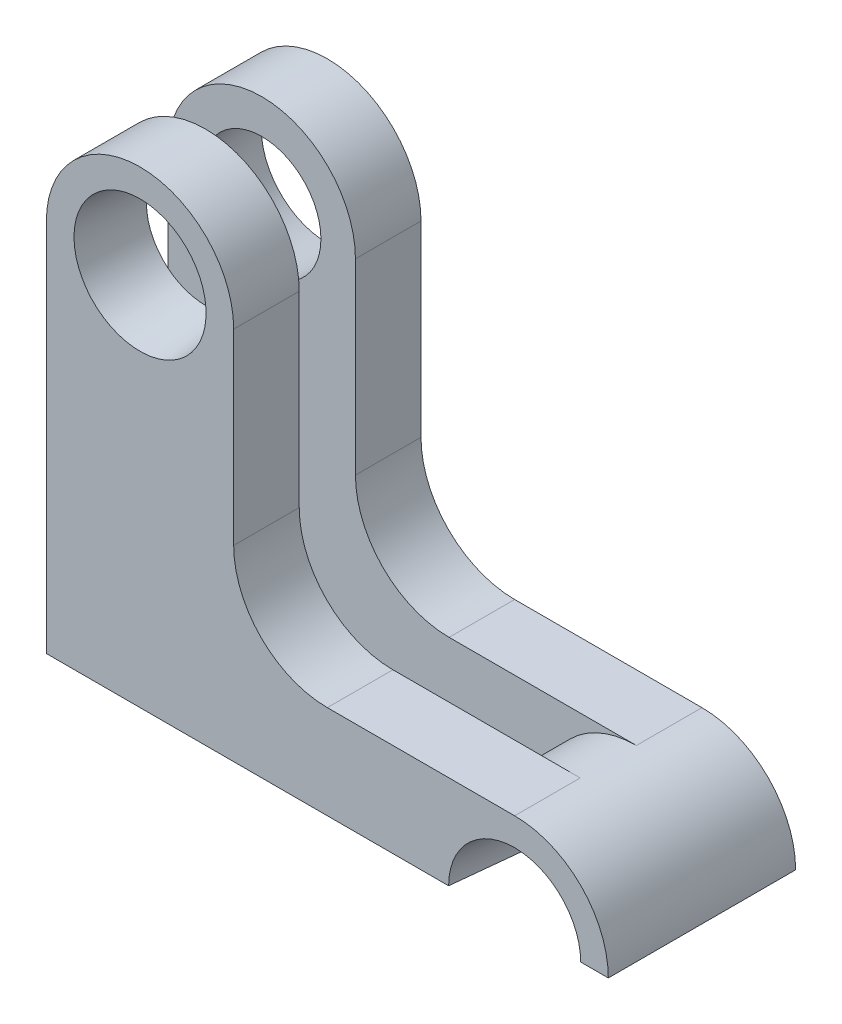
ISO-10303-21;
HEADER;
FILE_DESCRIPTION(('STEP AP214'),'2;1');
FILE_NAME('part.step','',(''),(''),'','','');
FILE_SCHEMA(('AUTOMOTIVE_DESIGN { 1 0 10303 214 1 1 1 1 }'));
ENDSEC;
DATA;
#1=APPLICATION_CONTEXT('core data for automotive mechanical design processes');
#2=APPLICATION_PROTOCOL_DEFINITION('international standard','automotive_design',2000,#1);
#3=PRODUCT_CONTEXT('',#1,'mechanical');
#4=PRODUCT('Part','Part','',(#3));
#5=PRODUCT_RELATED_PRODUCT_CATEGORY('part','',(#4));
#6=PRODUCT_DEFINITION_FORMATION('','',#4);
#7=PRODUCT_DEFINITION_CONTEXT('part definition',#1,'design');
#8=PRODUCT_DEFINITION('design','',#6,#7);
#9=PRODUCT_DEFINITION_SHAPE('','',#8);
#10=(LENGTH_UNIT() NAMED_UNIT(*) SI_UNIT(.MILLI.,.METRE.));
#11=(NAMED_UNIT(*) PLANE_ANGLE_UNIT() SI_UNIT($,.RADIAN.));
#12=(NAMED_UNIT(*) SI_UNIT($,.STERADIAN.) SOLID_ANGLE_UNIT());
#13=UNCERTAINTY_MEASURE_WITH_UNIT(LENGTH_MEASURE(1.E-05),#10,'distance_accuracy_value','');
#14=(GEOMETRIC_REPRESENTATION_CONTEXT(3) GLOBAL_UNCERTAINTY_ASSIGNED_CONTEXT((#13)) GLOBAL_UNIT_ASSIGNED_CONTEXT((#10,
#11,#12)) REPRESENTATION_CONTEXT('',''));
#15=CARTESIAN_POINT('',(0.,0.,0.));
#16=DIRECTION('',(0.,0.,1.));
#17=DIRECTION('',(1.,0.,0.));
#18=AXIS2_PLACEMENT_3D('',#15,#16,#17);
#19=CARTESIAN_POINT('',(0.,10.,10.));
#20=DIRECTION('',(0.,0.,-1.));
#21=DIRECTION('',(-1.,0.,0.));
#22=AXIS2_PLACEMENT_3D('',#19,#20,#21);
#23=PLANE('',#22);
#24=CARTESIAN_POINT('',(-40.,50.,10.));
#25=DIRECTION('',(0.,0.,-1.));
#26=DIRECTION('',(-1.,0.,0.));
#27=AXIS2_PLACEMENT_3D('',#24,#25,#26);
#28=CIRCLE('',#27,7.05104235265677);
#29=CARTESIAN_POINT('',(-47.0510423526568,50.,10.));
#30=VERTEX_POINT('',#29);
#31=EDGE_CURVE('E190',#30,#30,#28,.F.);
#32=ORIENTED_EDGE('',*,*,#31,.F.);
#33=EDGE_LOOP('',(#32));
#34=FACE_BOUND('',#33,.T.);
#35=DIRECTION('',(-1.,0.,0.));
#36=VECTOR('',#35,1.);
#37=CARTESIAN_POINT('',(0.,10.,10.));
#38=LINE('',#37,#36);
#39=CARTESIAN_POINT('',(10.,10.,10.));
#40=VERTEX_POINT('',#39);
#41=CARTESIAN_POINT('',(7.05104235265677,10.,10.));
#42=VERTEX_POINT('',#41);
#43=EDGE_CURVE('E48',#40,#42,#38,.T.);
#44=ORIENTED_EDGE('',*,*,#43,.F.);
#45=CARTESIAN_POINT('',(0.,10.,10.));
#46=DIRECTION('',(0.,0.,-1.));
#47=DIRECTION('',(-1.,0.,0.));
#48=AXIS2_PLACEMENT_3D('',#45,#46,#47);
#49=CIRCLE('',#48,10.);
#50=CARTESIAN_POINT('',(0.,20.,10.));
#51=VERTEX_POINT('',#50);
#52=EDGE_CURVE('E228',#51,#40,#49,.T.);
#53=ORIENTED_EDGE('',*,*,#52,.F.);
#54=DIRECTION('',(1.,0.,0.));
#55=VECTOR('',#54,1.);
#56=CARTESIAN_POINT('',(-19.9999999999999,20.,10.));
#57=LINE('',#56,#55);
#58=CARTESIAN_POINT('',(-19.9999999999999,20.,10.));
#59=VERTEX_POINT('',#58);
#60=EDGE_CURVE('E213',#59,#51,#57,.T.);
#61=ORIENTED_EDGE('',*,*,#60,.F.);
#62=CARTESIAN_POINT('',(-20.,30.,10.));
#63=DIRECTION('',(0.,0.,1.));
#64=DIRECTION('',(1.,0.,0.));
#65=AXIS2_PLACEMENT_3D('',#62,#63,#64);
#66=CIRCLE('',#65,10.);
#67=CARTESIAN_POINT('',(-30.,30.0000000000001,10.));
#68=VERTEX_POINT('',#67);
#69=EDGE_CURVE('E216',#68,#59,#66,.T.);
#70=ORIENTED_EDGE('',*,*,#69,.F.);
#71=DIRECTION('',(0.,-1.,0.));
#72=VECTOR('',#71,1.);
#73=CARTESIAN_POINT('',(-30.,50.,10.));
#74=LINE('',#73,#72);
#75=CARTESIAN_POINT('',(-30.,50.,10.));
#76=VERTEX_POINT('',#75);
#77=EDGE_CURVE('E219',#76,#68,#74,.T.);
#78=ORIENTED_EDGE('',*,*,#77,.F.);
#79=CARTESIAN_POINT('',(-40.,50.,10.));
#80=DIRECTION('',(0.,0.,-1.));
#81=DIRECTION('',(-1.,0.,0.));
#82=AXIS2_PLACEMENT_3D('',#79,#80,#81);
#83=CIRCLE('',#82,9.99999999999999);
#84=CARTESIAN_POINT('',(-50.,50.,10.));
#85=VERTEX_POINT('',#84);
#86=EDGE_CURVE('E222',#85,#76,#83,.T.);
#87=ORIENTED_EDGE('',*,*,#86,.F.);
#88=DIRECTION('',(0.,1.,0.));
#89=VECTOR('',#88,1.);
#90=CARTESIAN_POINT('',(-50.,10.0000000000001,10.));
#91=LINE('',#90,#89);
#92=CARTESIAN_POINT('',(-50.,10.0000000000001,10.));
#93=VERTEX_POINT('',#92);
#94=EDGE_CURVE('E225',#93,#85,#91,.T.);
#95=ORIENTED_EDGE('',*,*,#94,.F.);
#96=CARTESIAN_POINT('',(-7.05104235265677,10.,10.));
#97=VERTEX_POINT('',#96);
#98=EDGE_CURVE('E288',#97,#93,#38,.T.);
#99=ORIENTED_EDGE('',*,*,#98,.F.);
#100=CARTESIAN_POINT('',(0.,10.,10.));
#101=DIRECTION('',(0.,0.,-1.));
#102=DIRECTION('',(-1.,0.,0.));
#103=AXIS2_PLACEMENT_3D('',#100,#101,#102);
#104=CIRCLE('',#103,7.05104235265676);
#105=EDGE_CURVE('E161',#42,#97,#104,.F.);
#106=ORIENTED_EDGE('',*,*,#105,.F.);
#107=EDGE_LOOP('',(#44,#53,#61,#70,#78,#87,#95,#99,#106));
#108=FACE_BOUND('',#107,.T.);
#109=ADVANCED_FACE('F33',(#34,#108),#23,.F.);
#110=CARTESIAN_POINT('',(10.,60.001,3.));
#111=DIRECTION('',(0.,0.,-1.));
#112=DIRECTION('',(-1.,0.,0.));
#113=AXIS2_PLACEMENT_3D('',#110,#111,#112);
#114=PLANE('',#113);
#115=CARTESIAN_POINT('',(-40.,50.,3.));
#116=DIRECTION('',(0.,0.,-1.));
#117=DIRECTION('',(-1.,0.,0.));
#118=AXIS2_PLACEMENT_3D('',#115,#116,#117);
#119=CIRCLE('',#118,6.31531270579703);
#120=CARTESIAN_POINT('',(-46.315312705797,50.,3.));
#121=VERTEX_POINT('',#120);
#122=EDGE_CURVE('E184',#121,#121,#119,.F.);
#123=ORIENTED_EDGE('',*,*,#122,.T.);
#124=EDGE_LOOP('',(#123));
#125=FACE_BOUND('',#124,.T.);
#126=CARTESIAN_POINT('',(0.,10.,3.));
#127=DIRECTION('',(0.,0.,-1.));
#128=DIRECTION('',(-1.,0.,0.));
#129=AXIS2_PLACEMENT_3D('',#126,#127,#128);
#130=CIRCLE('',#129,10.);
#131=CARTESIAN_POINT('',(-10.,10.,3.));
#132=VERTEX_POINT('',#131);
#133=CARTESIAN_POINT('',(0.,20.,3.));
#134=VERTEX_POINT('',#133);
#135=EDGE_CURVE('E270',#132,#134,#130,.T.);
#136=ORIENTED_EDGE('',*,*,#135,.F.);
#137=DIRECTION('',(-1.,0.,0.));
#138=VECTOR('',#137,1.);
#139=CARTESIAN_POINT('',(10.,10.,3.));
#140=LINE('',#139,#138);
#141=CARTESIAN_POINT('',(-50.,10.,3.));
#142=VERTEX_POINT('',#141);
#143=EDGE_CURVE('E283',#132,#142,#140,.T.);
#144=ORIENTED_EDGE('',*,*,#143,.T.);
#145=DIRECTION('',(0.,-1.,0.));
#146=VECTOR('',#145,1.);
#147=CARTESIAN_POINT('',(-50.,60.001,3.));
#148=LINE('',#147,#146);
#149=CARTESIAN_POINT('',(-50.,50.,3.));
#150=VERTEX_POINT('',#149);
#151=EDGE_CURVE('E269',#150,#142,#148,.T.);
#152=ORIENTED_EDGE('',*,*,#151,.F.);
#153=CARTESIAN_POINT('',(-40.,50.,3.));
#154=DIRECTION('',(0.,0.,-1.));
#155=DIRECTION('',(-1.,0.,0.));
#156=AXIS2_PLACEMENT_3D('',#153,#154,#155);
#157=CIRCLE('',#156,9.99999999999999);
#158=CARTESIAN_POINT('',(-30.,50.,3.));
#159=VERTEX_POINT('',#158);
#160=EDGE_CURVE('E266',#159,#150,#157,.F.);
#161=ORIENTED_EDGE('',*,*,#160,.F.);
#162=DIRECTION('',(0.,1.,0.));
#163=VECTOR('',#162,1.);
#164=CARTESIAN_POINT('',(-30.,50.,3.));
#165=LINE('',#164,#163);
#166=CARTESIAN_POINT('',(-30.,30.0000000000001,3.));
#167=VERTEX_POINT('',#166);
#168=EDGE_CURVE('E263',#167,#159,#165,.T.);
#169=ORIENTED_EDGE('',*,*,#168,.F.);
#170=CARTESIAN_POINT('',(-20.,30.,3.));
#171=DIRECTION('',(0.,0.,-1.));
#172=DIRECTION('',(-1.,0.,0.));
#173=AXIS2_PLACEMENT_3D('',#170,#171,#172);
#174=CIRCLE('',#173,10.);
#175=CARTESIAN_POINT('',(-19.9999999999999,20.,3.));
#176=VERTEX_POINT('',#175);
#177=EDGE_CURVE('E260',#176,#167,#174,.T.);
#178=ORIENTED_EDGE('',*,*,#177,.F.);
#179=DIRECTION('',(-1.,0.,0.));
#180=VECTOR('',#179,1.);
#181=CARTESIAN_POINT('',(-19.9999999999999,20.,3.));
#182=LINE('',#181,#180);
#183=EDGE_CURVE('E257',#134,#176,#182,.T.);
#184=ORIENTED_EDGE('',*,*,#183,.F.);
#185=EDGE_LOOP('',(#136,#144,#152,#161,#169,#178,#184));
#186=FACE_BOUND('',#185,.T.);
#187=ADVANCED_FACE('F350',(#125,#186),#114,.T.);
#188=CARTESIAN_POINT('',(0.,10.,10.));
#189=DIRECTION('',(0.,0.,-1.));
#190=DIRECTION('',(-1.,0.,0.));
#191=AXIS2_PLACEMENT_3D('',#188,#189,#190);
#192=CYLINDRICAL_SURFACE('',#191,10.);
#193=CARTESIAN_POINT('',(0.,10.,-3.));
#194=DIRECTION('',(0.,0.,1.));
#195=DIRECTION('',(1.,0.,0.));
#196=AXIS2_PLACEMENT_3D('',#193,#194,#195);
#197=CIRCLE('',#196,10.);
#198=CARTESIAN_POINT('',(0.,20.,-3.));
#199=VERTEX_POINT('',#198);
#200=CARTESIAN_POINT('',(-10.,10.,-3.));
#201=VERTEX_POINT('',#200);
#202=EDGE_CURVE('E273',#199,#201,#197,.T.);
#203=ORIENTED_EDGE('',*,*,#202,.T.);
#204=DIRECTION('',(0.,0.,-1.));
#205=VECTOR('',#204,1.);
#206=CARTESIAN_POINT('',(-10.,10.,10.));
#207=LINE('',#206,#205);
#208=EDGE_CURVE('E56',#201,#132,#207,.F.);
#209=ORIENTED_EDGE('',*,*,#208,.T.);
#210=ORIENTED_EDGE('',*,*,#135,.T.);
#211=DIRECTION('',(0.,0.,-1.));
#212=VECTOR('',#211,1.);
#213=CARTESIAN_POINT('',(0.,20.,10.));
#214=LINE('',#213,#212);
#215=EDGE_CURVE('E178',#51,#134,#214,.T.);
#216=ORIENTED_EDGE('',*,*,#215,.F.);
#217=ORIENTED_EDGE('',*,*,#52,.T.);
#218=DIRECTION('',(0.,0.,1.));
#219=VECTOR('',#218,1.);
#220=CARTESIAN_POINT('',(10.,10.,-98.9724735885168));
#221=LINE('',#220,#219);
#222=CARTESIAN_POINT('',(10.,10.,-10.));
#223=VERTEX_POINT('',#222);
#224=EDGE_CURVE('E294',#223,#40,#221,.T.);
#225=ORIENTED_EDGE('',*,*,#224,.F.);
#226=CARTESIAN_POINT('',(0.,10.,-10.));
#227=DIRECTION('',(0.,0.,-1.));
#228=DIRECTION('',(-1.,0.,0.));
#229=AXIS2_PLACEMENT_3D('',#226,#227,#228);
#230=CIRCLE('',#229,10.);
#231=CARTESIAN_POINT('',(0.,20.,-10.));
#232=VERTEX_POINT('',#231);
#233=EDGE_CURVE('E170',#232,#223,#230,.T.);
#234=ORIENTED_EDGE('',*,*,#233,.F.);
#235=EDGE_CURVE('E180',#199,#232,#214,.T.);
#236=ORIENTED_EDGE('',*,*,#235,.F.);
#237=EDGE_LOOP('',(#203,#209,#210,#216,#217,#225,#234,#236));
#238=FACE_BOUND('',#237,.T.);
#239=ADVANCED_FACE('F35',(#238),#192,.T.);
#240=CARTESIAN_POINT('',(0.,10.,-10.));
#241=DIRECTION('',(0.,0.,-1.));
#242=DIRECTION('',(-1.,0.,0.));
#243=AXIS2_PLACEMENT_3D('',#240,#241,#242);
#244=PLANE('',#243);
#245=CARTESIAN_POINT('',(-40.,50.,-10.));
#246=DIRECTION('',(0.,0.,-1.));
#247=DIRECTION('',(-1.,0.,0.));
#248=AXIS2_PLACEMENT_3D('',#245,#246,#247);
#249=CIRCLE('',#248,7.05104235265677);
#250=CARTESIAN_POINT('',(-47.0510423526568,50.,-10.));
#251=VERTEX_POINT('',#250);
#252=EDGE_CURVE('E189',#251,#251,#249,.T.);
#253=ORIENTED_EDGE('',*,*,#252,.F.);
#254=EDGE_LOOP('',(#253));
#255=FACE_BOUND('',#254,.T.);
#256=ORIENTED_EDGE('',*,*,#233,.T.);
#257=DIRECTION('',(-1.,0.,0.));
#258=VECTOR('',#257,1.);
#259=CARTESIAN_POINT('',(0.,10.,-10.));
#260=LINE('',#259,#258);
#261=CARTESIAN_POINT('',(7.05104235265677,10.,-9.99999999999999));
#262=VERTEX_POINT('',#261);
#263=EDGE_CURVE('E166',#223,#262,#260,.T.);
#264=ORIENTED_EDGE('',*,*,#263,.T.);
#265=CARTESIAN_POINT('',(0.,10.,-10.));
#266=DIRECTION('',(0.,0.,-1.));
#267=DIRECTION('',(-1.,0.,0.));
#268=AXIS2_PLACEMENT_3D('',#265,#266,#267);
#269=CIRCLE('',#268,7.05104235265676);
#270=CARTESIAN_POINT('',(-7.05104235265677,10.,-10.));
#271=VERTEX_POINT('',#270);
#272=EDGE_CURVE('E154',#271,#262,#269,.T.);
#273=ORIENTED_EDGE('',*,*,#272,.F.);
#274=CARTESIAN_POINT('',(-50.,10.0000000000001,-10.));
#275=VERTEX_POINT('',#274);
#276=EDGE_CURVE('E175',#271,#275,#260,.T.);
#277=ORIENTED_EDGE('',*,*,#276,.T.);
#278=DIRECTION('',(0.,1.,0.));
#279=VECTOR('',#278,1.);
#280=CARTESIAN_POINT('',(-50.,10.0000000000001,-10.));
#281=LINE('',#280,#279);
#282=CARTESIAN_POINT('',(-50.,50.,-10.));
#283=VERTEX_POINT('',#282);
#284=EDGE_CURVE('E241',#275,#283,#281,.T.);
#285=ORIENTED_EDGE('',*,*,#284,.T.);
#286=CARTESIAN_POINT('',(-40.,50.,-10.));
#287=DIRECTION('',(0.,0.,-1.));
#288=DIRECTION('',(-1.,0.,0.));
#289=AXIS2_PLACEMENT_3D('',#286,#287,#288);
#290=CIRCLE('',#289,9.99999999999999);
#291=CARTESIAN_POINT('',(-30.,50.,-10.));
#292=VERTEX_POINT('',#291);
#293=EDGE_CURVE('E238',#283,#292,#290,.T.);
#294=ORIENTED_EDGE('',*,*,#293,.T.);
#295=DIRECTION('',(0.,-1.,0.));
#296=VECTOR('',#295,1.);
#297=CARTESIAN_POINT('',(-30.,50.,-10.));
#298=LINE('',#297,#296);
#299=CARTESIAN_POINT('',(-30.,30.0000000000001,-10.));
#300=VERTEX_POINT('',#299);
#301=EDGE_CURVE('E235',#292,#300,#298,.T.);
#302=ORIENTED_EDGE('',*,*,#301,.T.);
#303=CARTESIAN_POINT('',(-20.,30.,-10.));
#304=DIRECTION('',(0.,0.,1.));
#305=DIRECTION('',(1.,0.,0.));
#306=AXIS2_PLACEMENT_3D('',#303,#304,#305);
#307=CIRCLE('',#306,10.);
#308=CARTESIAN_POINT('',(-19.9999999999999,20.,-10.));
#309=VERTEX_POINT('',#308);
#310=EDGE_CURVE('E232',#300,#309,#307,.T.);
#311=ORIENTED_EDGE('',*,*,#310,.T.);
#312=DIRECTION('',(1.,0.,0.));
#313=VECTOR('',#312,1.);
#314=CARTESIAN_POINT('',(-19.9999999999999,20.,-10.));
#315=LINE('',#314,#313);
#316=EDGE_CURVE('E230',#309,#232,#315,.T.);
#317=ORIENTED_EDGE('',*,*,#316,.T.);
#318=EDGE_LOOP('',(#256,#264,#273,#277,#285,#294,#302,#311,#317));
#319=FACE_BOUND('',#318,.T.);
#320=ADVANCED_FACE('F167',(#255,#319),#244,.T.);
#321=CARTESIAN_POINT('',(10.,60.001,-3.));
#322=DIRECTION('',(0.,0.,1.));
#323=DIRECTION('',(1.,0.,0.));
#324=AXIS2_PLACEMENT_3D('',#321,#322,#323);
#325=PLANE('',#324);
#326=CARTESIAN_POINT('',(-40.,50.,-3.));
#327=DIRECTION('',(0.,0.,1.));
#328=DIRECTION('',(1.,0.,0.));
#329=AXIS2_PLACEMENT_3D('',#326,#327,#328);
#330=CIRCLE('',#329,6.31531270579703);
#331=CARTESIAN_POINT('',(-33.684687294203,50.,-3.));
#332=VERTEX_POINT('',#331);
#333=EDGE_CURVE('E186',#332,#332,#330,.T.);
#334=ORIENTED_EDGE('',*,*,#333,.F.);
#335=EDGE_LOOP('',(#334));
#336=FACE_BOUND('',#335,.T.);
#337=DIRECTION('',(0.,-1.,0.));
#338=VECTOR('',#337,1.);
#339=CARTESIAN_POINT('',(-50.,60.001,-3.));
#340=LINE('',#339,#338);
#341=CARTESIAN_POINT('',(-50.,50.,-3.));
#342=VERTEX_POINT('',#341);
#343=CARTESIAN_POINT('',(-50.,9.99999999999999,-3.));
#344=VERTEX_POINT('',#343);
#345=EDGE_CURVE('E272',#342,#344,#340,.T.);
#346=ORIENTED_EDGE('',*,*,#345,.T.);
#347=DIRECTION('',(1.,0.,0.));
#348=VECTOR('',#347,1.);
#349=CARTESIAN_POINT('',(10.,10.,-3.));
#350=LINE('',#349,#348);
#351=EDGE_CURVE('E286',#344,#201,#350,.T.);
#352=ORIENTED_EDGE('',*,*,#351,.T.);
#353=ORIENTED_EDGE('',*,*,#202,.F.);
#354=DIRECTION('',(1.,0.,0.));
#355=VECTOR('',#354,1.);
#356=CARTESIAN_POINT('',(-19.9999999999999,20.,-3.));
#357=LINE('',#356,#355);
#358=CARTESIAN_POINT('',(-19.9999999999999,20.,-3.));
#359=VERTEX_POINT('',#358);
#360=EDGE_CURVE('E245',#359,#199,#357,.T.);
#361=ORIENTED_EDGE('',*,*,#360,.F.);
#362=CARTESIAN_POINT('',(-20.,30.,-3.));
#363=DIRECTION('',(0.,0.,1.));
#364=DIRECTION('',(1.,0.,0.));
#365=AXIS2_PLACEMENT_3D('',#362,#363,#364);
#366=CIRCLE('',#365,10.);
#367=CARTESIAN_POINT('',(-30.,30.0000000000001,-3.));
#368=VERTEX_POINT('',#367);
#369=EDGE_CURVE('E248',#368,#359,#366,.T.);
#370=ORIENTED_EDGE('',*,*,#369,.F.);
#371=DIRECTION('',(0.,-1.,0.));
#372=VECTOR('',#371,1.);
#373=CARTESIAN_POINT('',(-30.,50.,-3.));
#374=LINE('',#373,#372);
#375=CARTESIAN_POINT('',(-30.,50.,-3.));
#376=VERTEX_POINT('',#375);
#377=EDGE_CURVE('E251',#376,#368,#374,.T.);
#378=ORIENTED_EDGE('',*,*,#377,.F.);
#379=CARTESIAN_POINT('',(-40.,50.,-3.));
#380=DIRECTION('',(0.,0.,1.));
#381=DIRECTION('',(1.,0.,0.));
#382=AXIS2_PLACEMENT_3D('',#379,#380,#381);
#383=CIRCLE('',#382,9.99999999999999);
#384=EDGE_CURVE('E254',#342,#376,#383,.F.);
#385=ORIENTED_EDGE('',*,*,#384,.F.);
#386=EDGE_LOOP('',(#346,#352,#353,#361,#370,#378,#385));
#387=FACE_BOUND('',#386,.T.);
#388=ADVANCED_FACE('F327',(#336,#387),#325,.T.);
#389=CARTESIAN_POINT('',(0.,10.,0.));
#390=DIRECTION('',(0.,0.,1.));
#391=DIRECTION('',(1.,0.,0.));
#392=AXIS2_PLACEMENT_3D('',#389,#390,#391);
#393=CONICAL_SURFACE('',#392,6.,0.10471975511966);
#394=CARTESIAN_POINT('',(0.,10.,0.));
#395=DIRECTION('',(0.,0.,1.));
#396=DIRECTION('',(1.,0.,0.));
#397=AXIS2_PLACEMENT_3D('',#394,#395,#396);
#398=CIRCLE('',#397,6.);
#399=CARTESIAN_POINT('',(6.,10.,0.));
#400=VERTEX_POINT('',#399);
#401=CARTESIAN_POINT('',(-6.,10.,0.));
#402=VERTEX_POINT('',#401);
#403=EDGE_CURVE('E162',#400,#402,#398,.T.);
#404=ORIENTED_EDGE('',*,*,#403,.F.);
#405=DIRECTION('',(0.104528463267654,0.,0.994521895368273));
#406=VECTOR('',#405,1.);
#407=CARTESIAN_POINT('',(0.,10.,-57.0861867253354));
#408=LINE('',#407,#406);
#409=EDGE_CURVE('E173',#400,#42,#408,.T.);
#410=ORIENTED_EDGE('',*,*,#409,.T.);
#411=ORIENTED_EDGE('',*,*,#105,.T.);
#412=DIRECTION('',(0.104528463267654,0.,-0.994521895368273));
#413=VECTOR('',#412,1.);
#414=CARTESIAN_POINT('',(0.,10.,-57.0861867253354));
#415=LINE('',#414,#413);
#416=EDGE_CURVE('E289',#97,#402,#415,.T.);
#417=ORIENTED_EDGE('',*,*,#416,.T.);
#418=EDGE_LOOP('',(#404,#410,#411,#417));
#419=FACE_BOUND('',#418,.T.);
#420=ADVANCED_FACE('F390',(#419),#393,.F.);
#421=CARTESIAN_POINT('',(0.,10.,0.));
#422=DIRECTION('',(0.,0.,-1.));
#423=DIRECTION('',(1.,0.,0.));
#424=AXIS2_PLACEMENT_3D('',#421,#422,#423);
#425=CONICAL_SURFACE('',#424,6.,0.10471975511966);
#426=DIRECTION('',(-0.104528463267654,0.,-0.994521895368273));
#427=VECTOR('',#426,1.);
#428=CARTESIAN_POINT('',(0.,10.,57.0861867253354));
#429=LINE('',#428,#427);
#430=EDGE_CURVE('E11',#271,#402,#429,.F.);
#431=ORIENTED_EDGE('',*,*,#430,.F.);
#432=ORIENTED_EDGE('',*,*,#272,.T.);
#433=DIRECTION('',(-0.104528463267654,0.,0.994521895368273));
#434=VECTOR('',#433,1.);
#435=CARTESIAN_POINT('',(0.,10.,57.0861867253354));
#436=LINE('',#435,#434);
#437=EDGE_CURVE('E41',#400,#262,#436,.F.);
#438=ORIENTED_EDGE('',*,*,#437,.F.);
#439=ORIENTED_EDGE('',*,*,#403,.T.);
#440=EDGE_LOOP('',(#431,#432,#438,#439));
#441=FACE_BOUND('',#440,.T.);
#442=ADVANCED_FACE('F156',(#441),#425,.F.);
#443=CARTESIAN_POINT('',(-19.9999999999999,20.,10.));
#444=DIRECTION('',(0.,1.,0.));
#445=DIRECTION('',(-1.,0.,0.));
#446=AXIS2_PLACEMENT_3D('',#443,#444,#445);
#447=PLANE('',#446);
#448=DIRECTION('',(0.,0.,-1.));
#449=VECTOR('',#448,1.);
#450=CARTESIAN_POINT('',(-19.9999999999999,20.,10.));
#451=LINE('',#450,#449);
#452=EDGE_CURVE('E209',#359,#309,#451,.T.);
#453=ORIENTED_EDGE('',*,*,#452,.F.);
#454=ORIENTED_EDGE('',*,*,#360,.T.);
#455=ORIENTED_EDGE('',*,*,#235,.T.);
#456=ORIENTED_EDGE('',*,*,#316,.F.);
#457=EDGE_LOOP('',(#453,#454,#455,#456));
#458=FACE_BOUND('',#457,.T.);
#459=ADVANCED_FACE('F331',(#458),#447,.T.);
#460=ORIENTED_EDGE('',*,*,#215,.T.);
#461=ORIENTED_EDGE('',*,*,#183,.T.);
#462=EDGE_CURVE('E210',#59,#176,#451,.T.);
#463=ORIENTED_EDGE('',*,*,#462,.F.);
#464=ORIENTED_EDGE('',*,*,#60,.T.);
#465=EDGE_LOOP('',(#460,#461,#463,#464));
#466=FACE_BOUND('',#465,.T.);
#467=ADVANCED_FACE('F299',(#466),#447,.T.);
#468=CARTESIAN_POINT('',(-20.,30.,10.));
#469=DIRECTION('',(0.,0.,-1.));
#470=DIRECTION('',(-1.,0.,0.));
#471=AXIS2_PLACEMENT_3D('',#468,#469,#470);
#472=CYLINDRICAL_SURFACE('',#471,10.);
#473=DIRECTION('',(0.,0.,-1.));
#474=VECTOR('',#473,1.);
#475=CARTESIAN_POINT('',(-30.,30.0000000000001,10.));
#476=LINE('',#475,#474);
#477=EDGE_CURVE('E205',#368,#300,#476,.T.);
#478=ORIENTED_EDGE('',*,*,#477,.F.);
#479=ORIENTED_EDGE('',*,*,#369,.T.);
#480=ORIENTED_EDGE('',*,*,#452,.T.);
#481=ORIENTED_EDGE('',*,*,#310,.F.);
#482=EDGE_LOOP('',(#478,#479,#480,#481));
#483=FACE_BOUND('',#482,.T.);
#484=ADVANCED_FACE('F334',(#483),#472,.F.);
#485=ORIENTED_EDGE('',*,*,#462,.T.);
#486=ORIENTED_EDGE('',*,*,#177,.T.);
#487=EDGE_CURVE('E206',#68,#167,#476,.T.);
#488=ORIENTED_EDGE('',*,*,#487,.F.);
#489=ORIENTED_EDGE('',*,*,#69,.T.);
#490=EDGE_LOOP('',(#485,#486,#488,#489));
#491=FACE_BOUND('',#490,.T.);
#492=ADVANCED_FACE('F302',(#491),#472,.F.);
#493=CARTESIAN_POINT('',(-30.,50.,10.));
#494=DIRECTION('',(1.,0.,0.));
#495=DIRECTION('',(0.,1.,0.));
#496=AXIS2_PLACEMENT_3D('',#493,#494,#495);
#497=PLANE('',#496);
#498=DIRECTION('',(0.,0.,-1.));
#499=VECTOR('',#498,1.);
#500=CARTESIAN_POINT('',(-30.,50.,10.));
#501=LINE('',#500,#499);
#502=EDGE_CURVE('E201',#376,#292,#501,.T.);
#503=ORIENTED_EDGE('',*,*,#502,.F.);
#504=ORIENTED_EDGE('',*,*,#377,.T.);
#505=ORIENTED_EDGE('',*,*,#477,.T.);
#506=ORIENTED_EDGE('',*,*,#301,.F.);
#507=EDGE_LOOP('',(#503,#504,#505,#506));
#508=FACE_BOUND('',#507,.T.);
#509=ADVANCED_FACE('F339',(#508),#497,.T.);
#510=ORIENTED_EDGE('',*,*,#487,.T.);
#511=ORIENTED_EDGE('',*,*,#168,.T.);
#512=EDGE_CURVE('E202',#76,#159,#501,.T.);
#513=ORIENTED_EDGE('',*,*,#512,.F.);
#514=ORIENTED_EDGE('',*,*,#77,.T.);
#515=EDGE_LOOP('',(#510,#511,#513,#514));
#516=FACE_BOUND('',#515,.T.);
#517=ADVANCED_FACE('F306',(#516),#497,.T.);
#518=CARTESIAN_POINT('',(-40.,50.,10.));
#519=DIRECTION('',(0.,0.,-1.));
#520=DIRECTION('',(-1.,0.,0.));
#521=AXIS2_PLACEMENT_3D('',#518,#519,#520);
#522=CYLINDRICAL_SURFACE('',#521,9.99999999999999);
#523=DIRECTION('',(0.,0.,-1.));
#524=VECTOR('',#523,1.);
#525=CARTESIAN_POINT('',(-50.,50.,10.));
#526=LINE('',#525,#524);
#527=EDGE_CURVE('E196',#342,#283,#526,.T.);
#528=ORIENTED_EDGE('',*,*,#527,.F.);
#529=ORIENTED_EDGE('',*,*,#384,.T.);
#530=ORIENTED_EDGE('',*,*,#502,.T.);
#531=ORIENTED_EDGE('',*,*,#293,.F.);
#532=EDGE_LOOP('',(#528,#529,#530,#531));
#533=FACE_BOUND('',#532,.T.);
#534=ADVANCED_FACE('F341',(#533),#522,.T.);
#535=ORIENTED_EDGE('',*,*,#512,.T.);
#536=ORIENTED_EDGE('',*,*,#160,.T.);
#537=EDGE_CURVE('E198',#85,#150,#526,.T.);
#538=ORIENTED_EDGE('',*,*,#537,.F.);
#539=ORIENTED_EDGE('',*,*,#86,.T.);
#540=EDGE_LOOP('',(#535,#536,#538,#539));
#541=FACE_BOUND('',#540,.T.);
#542=ADVANCED_FACE('F308',(#541),#522,.T.);
#543=CARTESIAN_POINT('',(-50.,10.0000000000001,10.));
#544=DIRECTION('',(-1.,0.,0.));
#545=DIRECTION('',(0.,-1.,0.));
#546=AXIS2_PLACEMENT_3D('',#543,#544,#545);
#547=PLANE('',#546);
#548=DIRECTION('',(0.,0.,-1.));
#549=VECTOR('',#548,1.);
#550=CARTESIAN_POINT('',(-50.,10.0000000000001,10.));
#551=LINE('',#550,#549);
#552=EDGE_CURVE('E197',#344,#275,#551,.T.);
#553=ORIENTED_EDGE('',*,*,#552,.F.);
#554=ORIENTED_EDGE('',*,*,#345,.F.);
#555=ORIENTED_EDGE('',*,*,#527,.T.);
#556=ORIENTED_EDGE('',*,*,#284,.F.);
#557=EDGE_LOOP('',(#553,#554,#555,#556));
#558=FACE_BOUND('',#557,.T.);
#559=ADVANCED_FACE('F321',(#558),#547,.T.);
#560=ORIENTED_EDGE('',*,*,#537,.T.);
#561=ORIENTED_EDGE('',*,*,#151,.T.);
#562=EDGE_CURVE('E193',#93,#142,#551,.T.);
#563=ORIENTED_EDGE('',*,*,#562,.F.);
#564=ORIENTED_EDGE('',*,*,#94,.T.);
#565=EDGE_LOOP('',(#560,#561,#563,#564));
#566=FACE_BOUND('',#565,.T.);
#567=ADVANCED_FACE('F312',(#566),#547,.T.);
#568=CARTESIAN_POINT('',(-40.,50.,0.));
#569=DIRECTION('',(0.,0.,1.));
#570=DIRECTION('',(1.,0.,0.));
#571=AXIS2_PLACEMENT_3D('',#568,#569,#570);
#572=CONICAL_SURFACE('',#571,6.,0.10471975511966);
#573=ORIENTED_EDGE('',*,*,#122,.F.);
#574=EDGE_LOOP('',(#573));
#575=FACE_BOUND('',#574,.T.);
#576=ORIENTED_EDGE('',*,*,#31,.T.);
#577=EDGE_LOOP('',(#576));
#578=FACE_BOUND('',#577,.T.);
#579=ADVANCED_FACE('F435',(#575,#578),#572,.F.);
#580=CARTESIAN_POINT('',(-40.,50.,0.));
#581=DIRECTION('',(0.,0.,-1.));
#582=DIRECTION('',(1.,0.,0.));
#583=AXIS2_PLACEMENT_3D('',#580,#581,#582);
#584=CONICAL_SURFACE('',#583,6.,0.10471975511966);
#585=ORIENTED_EDGE('',*,*,#252,.T.);
#586=EDGE_LOOP('',(#585));
#587=FACE_BOUND('',#586,.T.);
#588=ORIENTED_EDGE('',*,*,#333,.T.);
#589=EDGE_LOOP('',(#588));
#590=FACE_BOUND('',#589,.T.);
#591=ADVANCED_FACE('F430',(#587,#590),#584,.F.);
#592=CARTESIAN_POINT('',(-50.,10.,-98.9724735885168));
#593=DIRECTION('',(0.,-1.,0.));
#594=DIRECTION('',(1.,0.,0.));
#595=AXIS2_PLACEMENT_3D('',#592,#593,#594);
#596=PLANE('',#595);
#597=ORIENTED_EDGE('',*,*,#224,.T.);
#598=ORIENTED_EDGE('',*,*,#43,.T.);
#599=ORIENTED_EDGE('',*,*,#409,.F.);
#600=ORIENTED_EDGE('',*,*,#437,.T.);
#601=ORIENTED_EDGE('',*,*,#263,.F.);
#602=EDGE_LOOP('',(#597,#598,#599,#600,#601));
#603=FACE_BOUND('',#602,.T.);
#604=ADVANCED_FACE('F177',(#603),#596,.T.);
#605=ORIENTED_EDGE('',*,*,#143,.F.);
#606=ORIENTED_EDGE('',*,*,#208,.F.);
#607=ORIENTED_EDGE('',*,*,#351,.F.);
#608=ORIENTED_EDGE('',*,*,#552,.T.);
#609=ORIENTED_EDGE('',*,*,#276,.F.);
#610=ORIENTED_EDGE('',*,*,#430,.T.);
#611=ORIENTED_EDGE('',*,*,#416,.F.);
#612=ORIENTED_EDGE('',*,*,#98,.T.);
#613=ORIENTED_EDGE('',*,*,#562,.T.);
#614=EDGE_LOOP('',(#605,#606,#607,#608,#609,#610,#611,#612,#613));
#615=FACE_BOUND('',#614,.T.);
#616=ADVANCED_FACE('F315',(#615),#596,.T.);
#617=CLOSED_SHELL('',(#109,#187,#239,#320,#388,#420,#442,#459,#467,#484,#492,#509,#517,#534,
#542,#559,#567,#579,#591,#604,#616));
#618=MANIFOLD_SOLID_BREP('B2',#617);
#619=ADVANCED_BREP_SHAPE_REPRESENTATION('',(#18,#618),#14);
#620=SHAPE_DEFINITION_REPRESENTATION(#9,#619);
ENDSEC;
END-ISO-10303-21;
